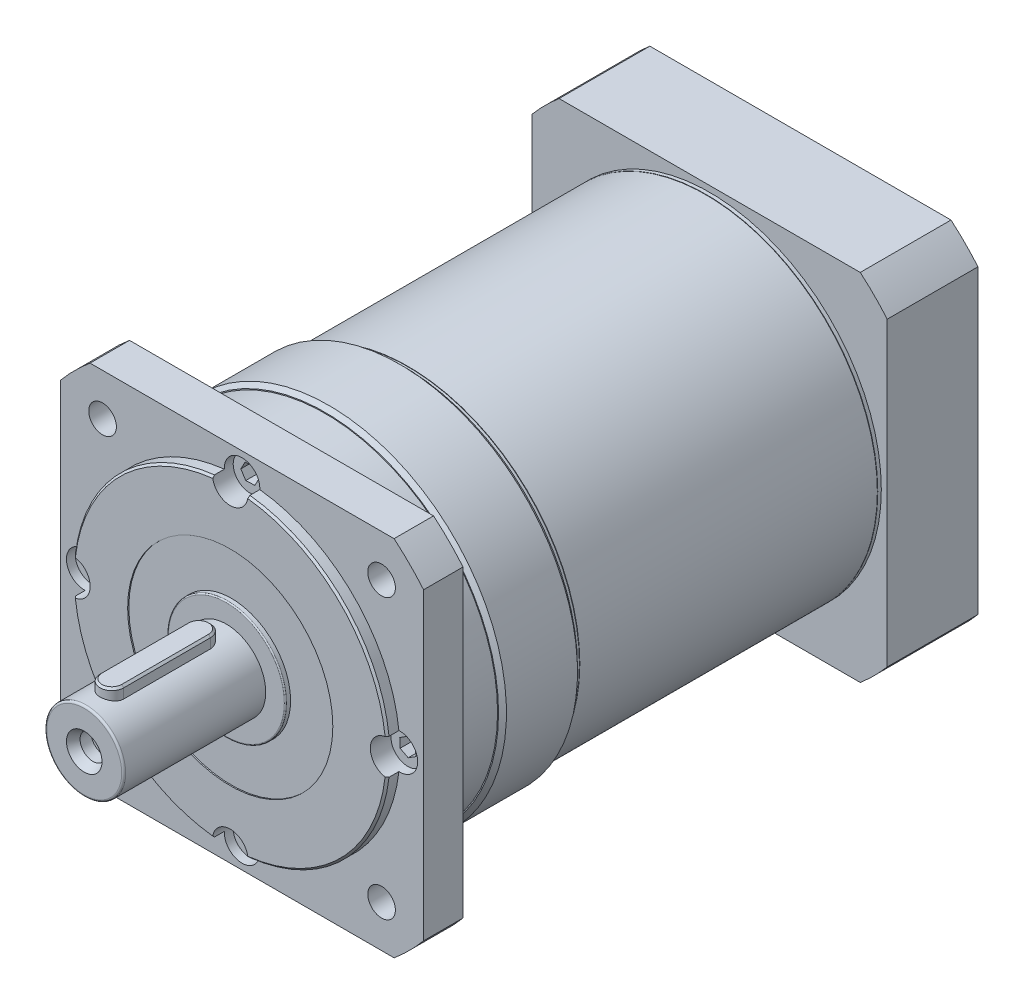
from build123d import *

# Parameters (mm, degrees)
SKETCH_1_R               = 45
EXTRUDE_1_DEPTH          = 42
SKETCH_2_R               = 40
EXTRUDE_2_DEPTH          = 3
SKETCH_3_OUTSIDE_W       = 119
SKETCH_3_OUTSIDE_H       = 119
SKETCH_3_OUTSIDE_R       = 43.5
CUT_EXTRUDE_1_DEPTH      = 1
SKETCH_25_W              = 92
SKETCH_25_H              = 92
EXTRUDE_13_DEPTH         = 10
SKETCH_26_OUTSIDE_W      = 121.534
SKETCH_26_OUTSIDE_H      = 121.534
SKETCH_26_OUTSIDE_R      = 60
CUT_EXTRUDE_8_DEPTH      = 10
SKETCH_27_R              = 3.5
CUT_EXTRUDE_9_DEPTH      = 10
PATTERN_CIRCULAR_6_COUNT = 4
SKETCH_28_OUTSIDE_W      = 121.534
SKETCH_28_OUTSIDE_H      = 121.534
SKETCH_28_OUTSIDE_R      = 43.75
CUT_EXTRUDE_10_DEPTH     = 11
CHAMFER_5_SIZE           = 1
CHAMFER_1_SIZE           = 1
SKETCH_4_R               = 43.5
EXTRUDE_3_DEPTH          = 75.4
SKETCH_5_R               = 43.5
EXTRUDE_4_DEPTH          = 0.9
EXTRUDE_5_DEPTH          = 23
SKETCH_7_R               = 35
CUT_EXTRUDE_2_DEPTH      = 6
SKETCH_8_R               = 32
CUT_EXTRUDE_3_DEPTH      = 20
SKETCH_9_R               = 4.5
CUT_EXTRUDE_4_DEPTH      = 14
PATTERN_CIRCULAR_1_COUNT = 4
PATTERN_CIRCULAR_2_COUNT = 4
SKETCH_12_R              = 4.25
EXTRUDE_6_DEPTH          = 5
PATTERN_CIRCULAR_3_COUNT = 4
SKETCH_13_R              = 4.5
CUT_EXTRUDE_5_DEPTH      = 7
PATTERN_CIRCULAR_4_COUNT = 4
SKETCH_14_R              = 4.25
EXTRUDE_7_DEPTH          = 5
PATTERN_CIRCULAR_5_COUNT = 4
SKETCH_17_R              = 26
EXTRUDE_8_DEPTH          = 19
CHAMFER_2_SIZE           = 1.5
SKETCH_18_W              = 61.385276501
SKETCH_18_H              = 1
CUT_EXTRUDE_6_DEPTH      = 19
SKETCH_19_R              = 9.5
CUT_EXTRUDE_7_DEPTH      = 42
CHAMFER_3_SIZE           = 0.5
SKETCH_20_R              = 15
EXTRUDE_9_DEPTH          = 1
FILLET_2_R               = 0.3
SKETCH_22_R              = 10
EXTRUDE_10_DEPTH         = 36
FILLET_3_R               = 0.5
EXTRUDE_11_DEPTH         = 12.5
CHAMFER_4_SIZE           = 0.5
SKETCH_30_R              = 4.5
CUT_EXTRUDE_11_DEPTH     = 3
PATTERN_CIRCULAR_8_COUNT = 4
CUT_EXTRUDE_START        = -0.3
SKETCH_31_R              = 26
SKETCH_31_R_2            = 15
CUT_EXTRUDE_12_DEPTH     = 0.3
SKETCH_33_R              = 3.25
CUT_EXTRUDE_13_DEPTH     = 5
SKETCH_34_R              = 3.25
SKETCH_32_R              = 4.5


with BuildPart() as part:
    # Sketch 1 → Extrude 1 (new body)
    with BuildSketch(Plane.XY):
        with Locations(Location((0, 0, 0), (0, 0, 180))):
            Circle(SKETCH_1_R)
    extrude(amount=EXTRUDE_1_DEPTH)

    # Sketch 2 → Extrude 2 (add)
    with BuildSketch(Plane.XY.offset(42)):
        Circle(SKETCH_2_R)
    extrude(amount=EXTRUDE_2_DEPTH)

    # Sketch 3 outside → Cut-Extrude 1 (cut)
    with BuildSketch(Plane(origin=(0, 0, 0), x_dir=(-1, 0, 0), z_dir=(0, 0, -1))):
        Rectangle(SKETCH_3_OUTSIDE_W, SKETCH_3_OUTSIDE_H)
        Circle(SKETCH_3_OUTSIDE_R, mode=Mode.SUBTRACT)
    extrude(amount=-CUT_EXTRUDE_1_DEPTH, mode=Mode.SUBTRACT)

    # Sketch 25 → Extrude 13 (add)
    with BuildSketch(Plane.XY.offset(42)):
        Rectangle(SKETCH_25_W, SKETCH_25_H)
    extrude(amount=-EXTRUDE_13_DEPTH)

    # Sketch 26 outside → Cut-Extrude 8 (cut)
    with BuildSketch(Plane.XY.offset(42)):
        Rectangle(SKETCH_26_OUTSIDE_W, SKETCH_26_OUTSIDE_H)
        Circle(SKETCH_26_OUTSIDE_R, mode=Mode.SUBTRACT)
    extrude(amount=-CUT_EXTRUDE_8_DEPTH, mode=Mode.SUBTRACT)

    # Sketch 27 → Cut-Extrude 9 (cut)
    with BuildSketch(Plane.XY.offset(42)):
        with Locations((-35.355339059, 35.355339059)):
            Circle(SKETCH_27_R)
    cut_extrude_9 = extrude(amount=-CUT_EXTRUDE_9_DEPTH, mode=Mode.SUBTRACT)

    # Pattern Circular 6: Cut-Extrude 9 ×4 about axis
    pattern_circular_6_axis = Axis((0, 0, 0), (0, 0, 1))
    for i in range(1, PATTERN_CIRCULAR_6_COUNT):
        add(cut_extrude_9.rotate(pattern_circular_6_axis, i * 360 / PATTERN_CIRCULAR_6_COUNT), mode=Mode.SUBTRACT)

    # Sketch 28 outside → Cut-Extrude 10 (cut)
    with BuildSketch(Plane(origin=(0, 0, 32), x_dir=(-1, 0, 0), z_dir=(0, 0, -1))):
        Rectangle(SKETCH_28_OUTSIDE_W, SKETCH_28_OUTSIDE_H)
        Circle(SKETCH_28_OUTSIDE_R, mode=Mode.SUBTRACT)
    extrude(amount=CUT_EXTRUDE_10_DEPTH, mode=Mode.SUBTRACT)

    # Chamfer 5
    chamfer_5_edges = [part.edges().sort_by_distance(p)[0] for p in [
        (45, 0, 21),
    ]]
    chamfer(chamfer_5_edges, length=CHAMFER_5_SIZE)

    # Chamfer 1
    chamfer_1_edges = [part.edges().sort_by_distance(p)[0] for p in [
        (45, 0, 1),
    ]]
    chamfer(chamfer_1_edges, length=CHAMFER_1_SIZE)

    # Sketch 13 → Cut-Extrude 5 (cut)
    with BuildSketch(Plane.XY.offset(42)):
        with Locations((0, -40)):
            Circle(SKETCH_13_R)
    cut_extrude_5 = extrude(amount=-CUT_EXTRUDE_5_DEPTH, mode=Mode.SUBTRACT)

    # Pattern Circular 4: Cut-Extrude 5 ×4 about axis
    pattern_circular_4_axis = Axis((0, 0, 0), (0, 0, 1))
    for i in range(1, PATTERN_CIRCULAR_4_COUNT):
        add(cut_extrude_5.rotate(pattern_circular_4_axis, i * 360 / PATTERN_CIRCULAR_4_COUNT), mode=Mode.SUBTRACT)

    # Sketch 14 → Extrude 7 (add)
    with BuildSketch(Plane.XY.offset(35)):
        with Locations((0, -40)):
            Circle(SKETCH_14_R)
        Polygon((1.070164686, -37.953519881), (-1.237221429, -38.049970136), (-2.307386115, -40.096450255), (-1.070164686, -42.046480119), (1.237221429, -41.950029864), (2.307386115, -39.903549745), align=None, mode=Mode.SUBTRACT)
    extrude_7 = extrude(amount=EXTRUDE_7_DEPTH)

    # Pattern Circular 5: Extrude 7 ×4 about axis
    pattern_circular_5_axis = Axis((0, 0, 0), (0, 0, 1))
    for i in range(1, PATTERN_CIRCULAR_5_COUNT):
        add(extrude_7.rotate(pattern_circular_5_axis, i * 360 / PATTERN_CIRCULAR_5_COUNT))

    # Chamfer 3
    chamfer_3_edges = [part.edges().sort_by_distance(p)[0] for p in [
        (-40, 0, 45),
    ]]
    chamfer(chamfer_3_edges, length=CHAMFER_3_SIZE)

    # Sketch 20 → Extrude 9 (add)
    with BuildSketch(Plane.XY.offset(45)):
        Circle(SKETCH_20_R)
    extrude(amount=EXTRUDE_9_DEPTH)

    # Fillet 2
    fillet_2_edges = [part.edges().sort_by_distance(p)[0] for p in [
        (-15, 0, 46),
    ]]
    fillet(fillet_2_edges, radius=FILLET_2_R)

    # Sketch 22 → Extrude 10 (add)
    with BuildSketch(Plane.XY.offset(46)):
        Circle(SKETCH_22_R)
    extrude(amount=EXTRUDE_10_DEPTH)

    # Fillet 3
    fillet_3_edges = [part.edges().sort_by_distance(p)[0] for p in [
        (-10, 0, 82),
    ]]
    fillet(fillet_3_edges, radius=FILLET_3_R)

    # Sketch 23 → Extrude 11 (add)
    with BuildSketch(Plane(origin=(0, 0, 0), x_dir=(1, 0, 0), z_dir=(0, 1, 0))):
        with BuildLine():
            Line((-3, -53), (-3, -75))
            ThreePointArc((-3, -75), (0, -78), (3, -75))
            Line((3, -75), (3, -53))
            ThreePointArc((3, -53), (0, -50), (-3, -53))
        make_face()
    extrude(amount=EXTRUDE_11_DEPTH)

    # Chamfer 4
    chamfer_4_edges = [part.edges().sort_by_distance(p)[0] for p in [
        (0, 12.5, 50),
        (-3, 12.5, 64),
        (0, 12.5, 78),
        (3, 12.5, 64),
    ]]
    chamfer(chamfer_4_edges, length=CHAMFER_4_SIZE)

    # Sketch 30 → Cut-Extrude 11 (cut)
    with BuildSketch(Plane.XY.offset(45)):
        with Locations(Location((0, 40, 0), (0, 0, 356.775410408))):
            Circle(SKETCH_30_R)
    cut_extrude_11 = extrude(amount=-CUT_EXTRUDE_11_DEPTH, mode=Mode.SUBTRACT)

    # Pattern Circular 8: Cut-Extrude 11 ×4 about axis
    pattern_circular_8_axis = Axis((0, 0, 45), (0, 0, -1))
    for i in range(1, PATTERN_CIRCULAR_8_COUNT):
        add(cut_extrude_11.rotate(pattern_circular_8_axis, i * 360 / PATTERN_CIRCULAR_8_COUNT), mode=Mode.SUBTRACT)

    # Sketch 31 → Cut-Extrude 12 (cut)
    with BuildSketch(Plane.XY.offset(45).offset(CUT_EXTRUDE_START)):
        Circle(SKETCH_31_R)
        Circle(SKETCH_31_R_2, mode=Mode.SUBTRACT)
    extrude(amount=CUT_EXTRUDE_12_DEPTH, mode=Mode.SUBTRACT)

    # Sketch 33 → Cut-Extrude 13 (cut)
    with BuildSketch(Plane.XY.offset(82)):
        Circle(SKETCH_33_R)
    extrude(amount=-CUT_EXTRUDE_13_DEPTH, mode=Mode.SUBTRACT)

    # Sketch 34 → Loft 1 section 0
    with BuildSketch(Plane.XY.offset(79.8)):
        Circle(SKETCH_34_R)
    # Sketch 32 → Loft 1 section 1
    with BuildSketch(Plane.XY.offset(82)):
        Circle(SKETCH_32_R)
    loft(mode=Mode.SUBTRACT)

    # Sketch 35 → Hole Wizard M6 _1 (revolve, cut)
    with BuildSketch(Plane(origin=(0, 0, 77), x_dir=(0, -1, 0), z_dir=(1, 0, 0))):
        Polygon((0, 0), (0, 18.002151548), (2.5, 16.5), (2.5, 0), align=None)
    revolve(axis=Axis((0, 0, 83.35), (0, 0, -1)), mode=Mode.SUBTRACT)


with BuildPart() as body_2:
    # Sketch 4 → Extrude 3 (new body)
    with BuildSketch(Plane(origin=(0, 0, -0.1), x_dir=(-1, 0, 0), z_dir=(0, 0, -1))):
        Circle(SKETCH_4_R)
    extrude(amount=EXTRUDE_3_DEPTH)


with BuildPart() as body_3:
    # Sketch 5 → Extrude 4 (new body)
    with BuildSketch(Plane(origin=(0, 0, -75.6), x_dir=(-1, 0, 0), z_dir=(0, 0, -1))):
        Circle(SKETCH_5_R)
    extrude(amount=EXTRUDE_4_DEPTH)

    # Sketch 6 → Extrude 5 (add)
    with BuildSketch(Plane(origin=(0, 0, -76.5), x_dir=(-1, 0, 0), z_dir=(0, 0, -1))):
        with BuildLine():
            Line((-38.157568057, 45), (38.157568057, 45))
            ThreePointArc((38.157568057, 45), (41.71930009, 41.71930009), (45, 38.157568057))
            Line((45, 38.157568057), (45, -38.157568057))
            ThreePointArc((45, -38.157568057), (41.71930009, -41.71930009), (38.157568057, -45))
            Line((38.157568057, -45), (-38.157568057, -45))
            ThreePointArc((-38.157568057, -45), (-41.71930009, -41.71930009), (-45, -38.157568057))
            Line((-45, -38.157568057), (-45, 38.157568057))
            ThreePointArc((-45, 38.157568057), (-41.71930009, 41.71930009), (-38.157568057, 45))
        make_face()
    extrude(amount=EXTRUDE_5_DEPTH)

    # Sketch 7 → Cut-Extrude 2 (cut)
    with BuildSketch(Plane(origin=(0, 0, -99.5), x_dir=(-1, 0, 0), z_dir=(0, 0, -1))):
        Circle(SKETCH_7_R)
    extrude(amount=-CUT_EXTRUDE_2_DEPTH, mode=Mode.SUBTRACT)


with BuildPart() as cut_extrude_3_tool:
    # Sketch 8 → Cut-Extrude 3 (new body)
    with BuildSketch(Plane(origin=(0, 0, -93.5), x_dir=(-1, 0, 0), z_dir=(0, 0, -1))):
        Circle(SKETCH_8_R)
    extrude(amount=-CUT_EXTRUDE_3_DEPTH)


with BuildPart() as body_2_1:
    add(body_2.part)

    # Cut-Extrude 3: cut by cut_extrude_3_tool
    add(cut_extrude_3_tool.part, mode=Mode.SUBTRACT)

    # Sketch 17 → Extrude 8 (add)
    with BuildSketch(Plane(origin=(0, 0, -92.5), x_dir=(-1, 0, 0), z_dir=(0, 0, -1))):
        Circle(SKETCH_17_R)
    extrude(amount=-EXTRUDE_8_DEPTH)

    # Chamfer 2
    chamfer_2_edges = [body_2_1.edges().sort_by_distance(p)[0] for p in [
        (26, 0, -92.5),
    ]]
    chamfer(chamfer_2_edges, length=CHAMFER_2_SIZE)

    # Sketch 18 → Cut-Extrude 6 (cut)
    with BuildSketch(Plane(origin=(0, 0, -92.5), x_dir=(-1, 0, 0), z_dir=(0, 0, -1))):
        with Locations((0.110137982, 0)):
            Rectangle(SKETCH_18_W, SKETCH_18_H)
    extrude(amount=-CUT_EXTRUDE_6_DEPTH, mode=Mode.SUBTRACT)

    # Sketch 19 → Cut-Extrude 7 (cut)
    with BuildSketch(Plane(origin=(0, 0, -99.5), x_dir=(-1, 0, 0), z_dir=(0, 0, -1))):
        Circle(SKETCH_19_R)
    extrude(amount=-CUT_EXTRUDE_7_DEPTH, mode=Mode.SUBTRACT)


with BuildPart() as body_3_1:
    add(body_3.part)

    # Cut-Extrude 3: cut by cut_extrude_3_tool
    add(cut_extrude_3_tool.part, mode=Mode.SUBTRACT)

    # Sketch 9 → Cut-Extrude 4 (cut)
    with BuildSketch(Plane(origin=(0, 0, -99.5), x_dir=(-1, 0, 0), z_dir=(0, 0, -1))):
        with Locations((-13.680805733, 37.587704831)):
            Circle(SKETCH_9_R)
    cut_extrude_4 = extrude(amount=-CUT_EXTRUDE_4_DEPTH, mode=Mode.SUBTRACT)

    # Pattern Circular 1: Cut-Extrude 4 ×4 about axis
    pattern_circular_1_axis = Axis((0, 0, 0), (0, 0, 1))
    for i in range(1, PATTERN_CIRCULAR_1_COUNT):
        add(cut_extrude_4.rotate(pattern_circular_1_axis, i * 360 / PATTERN_CIRCULAR_1_COUNT), mode=Mode.SUBTRACT)

    # Sketch 11 → Hole Wizard M5 _1 (revolve, cut)
    with BuildSketch(Plane(origin=(31.819805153, 31.819805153, -99.5), x_dir=(0, 1, 0), z_dir=(1, 0, 0))):
        Polygon((0, 0), (0, 17.2618073), (2.1, 16), (2.1, 0), align=None)
    hole_wizard_m5_1 = revolve(axis=Axis((31.819805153, 31.819805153, -105.85), (0, 0, 1)), mode=Mode.SUBTRACT)

    # Pattern Circular 2: Hole Wizard M5 _1 ×4 about axis
    pattern_circular_2_axis = Axis((0, 0, 0), (0, 0, 1))
    for i in range(1, PATTERN_CIRCULAR_2_COUNT):
        add(hole_wizard_m5_1.rotate(pattern_circular_2_axis, i * 360 / PATTERN_CIRCULAR_2_COUNT), mode=Mode.SUBTRACT)

    # Sketch 12 → Extrude 6 (add)
    with BuildSketch(Plane(origin=(0, 0, -85.5), x_dir=(-1, 0, 0), z_dir=(0, 0, -1))):
        with Locations((-13.680805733, 37.587704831)):
            Circle(SKETCH_12_R)
        Polygon((-12.613258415, 39.635551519), (-14.920519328, 39.536151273), (-15.988066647, 37.488304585), (-14.748353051, 35.539858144), (-12.441092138, 35.63925839), (-11.373544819, 37.687105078), align=None, mode=Mode.SUBTRACT)
    extrude_6 = extrude(amount=EXTRUDE_6_DEPTH)

    # Pattern Circular 3: Extrude 6 ×4 about axis
    pattern_circular_3_axis = Axis((0, 0, 0), (0, 0, 1))
    for i in range(1, PATTERN_CIRCULAR_3_COUNT):
        add(extrude_6.rotate(pattern_circular_3_axis, i * 360 / PATTERN_CIRCULAR_3_COUNT))


solid = Compound([part.part, body_2_1.part, body_3_1.part])
